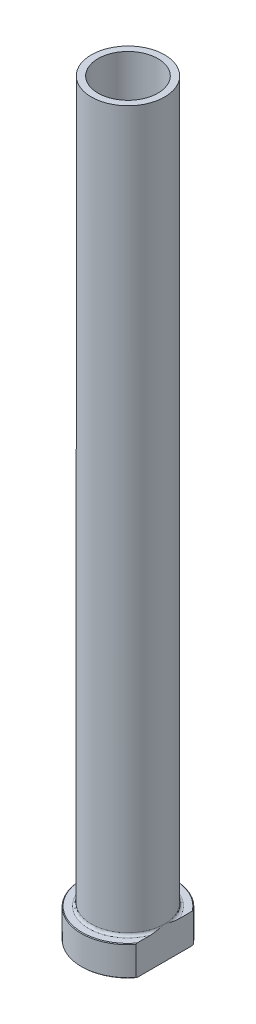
from build123d import *

# Parameters (mm, degrees)
FILLET1_R          = 0.8
CHAMFER1_SIZE      = 0.2
CUT_EXTRUDE1_DEPTH = 226.869431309
CHAMFER2_SIZE      = 0.5


with BuildPart() as part:
    # Sketch1 → Revolve1 (revolve)
    with BuildSketch(Plane.XY, mode=Mode.PRIVATE) as revolve1_sk:
        Polygon((-9, 225), (-11, 225), (-11, 9), (-14, 9), (-14, 0), (-9.25, 0), (-9.25, 158), (-9, 170), align=None)
    revolve(revolve1_sk.sketch.rotate(Axis((0, 92.187680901, 0), (0, -1, 0)), 270), axis=Axis((0, 92.187680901, 0), (0, -1, 0)))

    # Fillet1
    fillet1_edges = [part.edges().sort_by_distance(p)[0] for p in [
        (0, 9, -11),
    ]]
    fillet(fillet1_edges, radius=FILLET1_R)

    # Chamfer1
    chamfer1_edges = [part.edges().sort_by_distance(p)[0] for p in [
        (0, 0, -14),
        (0, 9, -14),
    ]]
    chamfer(chamfer1_edges, length=CHAMFER1_SIZE)

    # Sketch2 → Cut-Extrude1 (cut, through all)
    with BuildSketch(Plane.XZ):
        with BuildLine():
            Line((11, 8.660254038), (11, -8.660254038))
            ThreePointArc((11, -8.660254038), (14, 0), (11, 8.660254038))
        make_face()
    extrude(amount=-CUT_EXTRUDE1_DEPTH, mode=Mode.SUBTRACT)

    # Chamfer2
    chamfer2_edges = [part.edges().sort_by_distance(p)[0] for p in [
        (0, 0, -9.25),
    ]]
    chamfer(chamfer2_edges, length=CHAMFER2_SIZE)


solid = part.part
